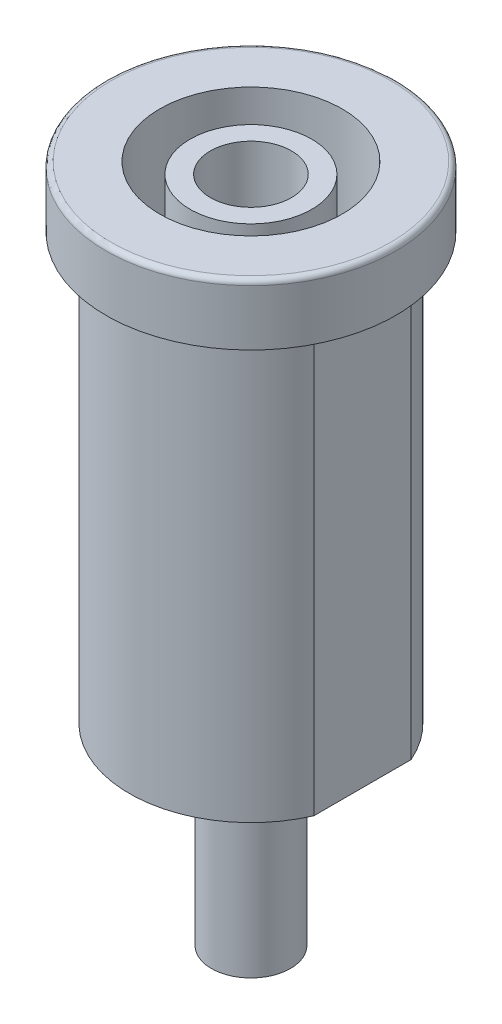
from build123d import *

# Parameters (mm, degrees)
ESQUISSE2_R             = 1.95
BOSS_EXTRU_1_DEPTH      = 9.5
ESQUISSE3_W             = 1.61463785
ESQUISSE3_H             = 13.78208736
ESQUISSE3_W_2           = 4.113482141
ESQUISSE3_H_2           = 14.800846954
ENL_V_MAT_EXTRU_1_DEPTH = 21


with BuildPart() as part:
    # Esquisse1 → R_volution1 (revolve)
    with BuildSketch(Plane.XY):
        with BuildLine():
            Line((0, -16.397502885), (-6, -16.397502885))
            Line((-6, -16.397502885), (-6, 4.602497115))
            Line((-6, 4.602497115), (-7.15, 4.602497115))
            Line((-7.15, 4.602497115), (-7.15, 7.352497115))
            ThreePointArc((-7.15, 7.352497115), (-7.076776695, 7.52927381), (-6.9, 7.602497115))
            Line((-6.9, 7.602497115), (-4.5, 7.602497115))
            Line((-4.5, 7.602497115), (-4.5, -14.397502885))
            Line((-4.5, -14.397502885), (-3, -14.397502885))
            Line((-3, -14.397502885), (-3, 7.0578229))
            Line((-3, 7.0578229), (-2, 7.0578229))
            Line((-2, 7.0578229), (-2, -12.397502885))
            Line((-2, -12.397502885), (0, -12.397502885))
            Line((0, -12.397502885), (0, -16.397502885))
        make_face()
    revolve(axis=Axis((0, 5.964182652, 0), (0, -1, 0)))

    # Esquisse2 → Boss.-Extru.1 (add)
    with BuildSketch(Plane.XZ.offset(16.397502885)):
        Circle(ESQUISSE2_R)
    extrude(amount=BOSS_EXTRU_1_DEPTH)

    # Esquisse3 → Enl_v. mat.-Extru.1 (cut)
    with BuildSketch(Plane.XZ.offset(16.397502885)):
        with Locations((-6.307318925, -0.480546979)):
            Rectangle(ESQUISSE3_W, ESQUISSE3_H)
        with Locations((7.556741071, -0.413270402)):
            Rectangle(ESQUISSE3_W_2, ESQUISSE3_H_2)
    extrude(amount=-ENL_V_MAT_EXTRU_1_DEPTH, mode=Mode.SUBTRACT)


solid = part.part
